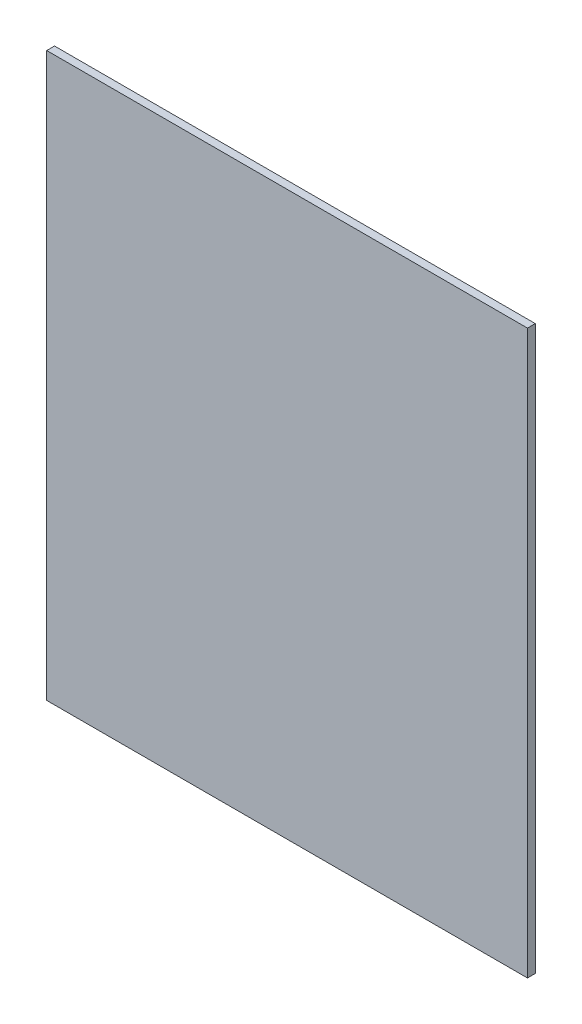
from build123d import *

# Parameters (mm, degrees)
ESQUISSE1_W      = 615
ESQUISSE1_H      = 720
EXTRUSION1_DEPTH = 10


with BuildPart() as part:
    # Esquisse1 → Extrusion1 (new body)
    with BuildSketch(Plane.XY):
        with Locations((307.5, 360)):
            Rectangle(ESQUISSE1_W, ESQUISSE1_H)
    extrude(amount=EXTRUSION1_DEPTH)


solid = part.part
